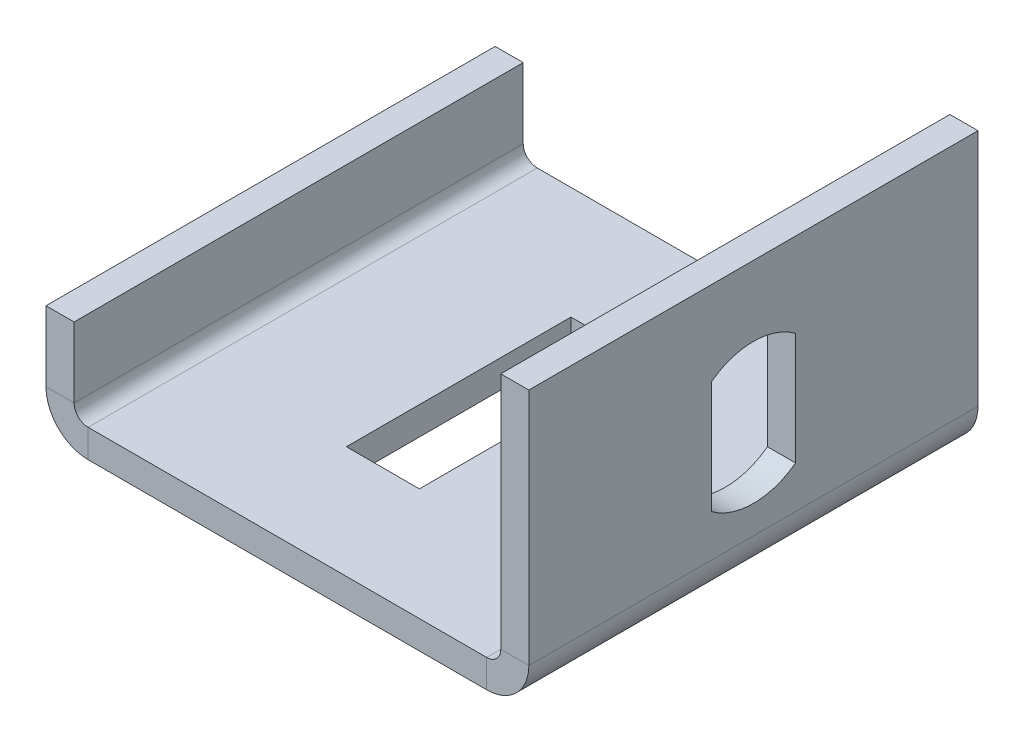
ISO-10303-21;
HEADER;
FILE_DESCRIPTION(('STEP AP214'),'2;1');
FILE_NAME('part.step','',(''),(''),'','','');
FILE_SCHEMA(('AUTOMOTIVE_DESIGN { 1 0 10303 214 1 1 1 1 }'));
ENDSEC;
DATA;
#1=APPLICATION_CONTEXT('core data for automotive mechanical design processes');
#2=APPLICATION_PROTOCOL_DEFINITION('international standard','automotive_design',2000,#1);
#3=PRODUCT_CONTEXT('',#1,'mechanical');
#4=PRODUCT('Part','Part','',(#3));
#5=PRODUCT_RELATED_PRODUCT_CATEGORY('part','',(#4));
#6=PRODUCT_DEFINITION_FORMATION('','',#4);
#7=PRODUCT_DEFINITION_CONTEXT('part definition',#1,'design');
#8=PRODUCT_DEFINITION('design','',#6,#7);
#9=PRODUCT_DEFINITION_SHAPE('','',#8);
#10=(LENGTH_UNIT() NAMED_UNIT(*) SI_UNIT(.MILLI.,.METRE.));
#11=(NAMED_UNIT(*) PLANE_ANGLE_UNIT() SI_UNIT($,.RADIAN.));
#12=(NAMED_UNIT(*) SI_UNIT($,.STERADIAN.) SOLID_ANGLE_UNIT());
#13=UNCERTAINTY_MEASURE_WITH_UNIT(LENGTH_MEASURE(1.E-05),#10,'distance_accuracy_value','');
#14=(GEOMETRIC_REPRESENTATION_CONTEXT(3) GLOBAL_UNCERTAINTY_ASSIGNED_CONTEXT((#13)) GLOBAL_UNIT_ASSIGNED_CONTEXT((#10,
#11,#12)) REPRESENTATION_CONTEXT('',''));
#15=CARTESIAN_POINT('',(0.,0.,0.));
#16=DIRECTION('',(0.,0.,1.));
#17=DIRECTION('',(1.,0.,0.));
#18=AXIS2_PLACEMENT_3D('',#15,#16,#17);
#19=CARTESIAN_POINT('',(166.941347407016,0.,80.));
#20=DIRECTION('',(0.,1.,0.));
#21=DIRECTION('',(-1.,0.,0.));
#22=AXIS2_PLACEMENT_3D('',#19,#20,#21);
#23=PLANE('',#22);
#24=DIRECTION('',(0.,0.,-1.));
#25=VECTOR('',#24,1.);
#26=CARTESIAN_POINT('',(0.,0.,80.));
#27=LINE('',#26,#25);
#28=CARTESIAN_POINT('',(0.,0.,80.));
#29=VERTEX_POINT('',#28);
#30=CARTESIAN_POINT('',(0.,0.,0.));
#31=VERTEX_POINT('',#30);
#32=EDGE_CURVE('E353',#29,#31,#27,.T.);
#33=ORIENTED_EDGE('',*,*,#32,.F.);
#34=DIRECTION('',(-1.,0.,0.));
#35=VECTOR('',#34,1.);
#36=CARTESIAN_POINT('',(166.941347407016,0.,80.));
#37=LINE('',#36,#35);
#38=CARTESIAN_POINT('',(4.99999999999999,0.,80.));
#39=VERTEX_POINT('',#38);
#40=EDGE_CURVE('E51',#39,#29,#37,.T.);
#41=ORIENTED_EDGE('',*,*,#40,.F.);
#42=DIRECTION('',(0.,0.,-1.));
#43=VECTOR('',#42,1.);
#44=CARTESIAN_POINT('',(5.,0.,80.));
#45=LINE('',#44,#43);
#46=CARTESIAN_POINT('',(4.99999999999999,0.,0.));
#47=VERTEX_POINT('',#46);
#48=EDGE_CURVE('E72',#39,#47,#45,.T.);
#49=ORIENTED_EDGE('',*,*,#48,.T.);
#50=DIRECTION('',(-1.,0.,0.));
#51=VECTOR('',#50,1.);
#52=CARTESIAN_POINT('',(166.941347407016,0.,0.));
#53=LINE('',#52,#51);
#54=EDGE_CURVE('E361',#47,#31,#53,.T.);
#55=ORIENTED_EDGE('',*,*,#54,.T.);
#56=EDGE_LOOP('',(#33,#41,#49,#55));
#57=FACE_BOUND('',#56,.T.);
#58=ADVANCED_FACE('F32',(#57),#23,.T.);
#59=CARTESIAN_POINT('',(166.941347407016,0.,0.));
#60=DIRECTION('',(0.,0.,1.));
#61=DIRECTION('',(0.,-1.,0.));
#62=AXIS2_PLACEMENT_3D('',#59,#60,#61);
#63=PLANE('',#62);
#64=DIRECTION('',(-1.,0.,0.));
#65=VECTOR('',#64,1.);
#66=CARTESIAN_POINT('',(166.941347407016,-12.5,0.));
#67=LINE('',#66,#65);
#68=CARTESIAN_POINT('',(5.,-12.5,0.));
#69=VERTEX_POINT('',#68);
#70=CARTESIAN_POINT('',(0.,-12.5,0.));
#71=VERTEX_POINT('',#70);
#72=EDGE_CURVE('E207',#69,#71,#67,.T.);
#73=ORIENTED_EDGE('',*,*,#72,.T.);
#74=DIRECTION('',(0.,-1.,0.));
#75=VECTOR('',#74,1.);
#76=CARTESIAN_POINT('',(0.,-9.99999999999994,0.));
#77=LINE('',#76,#75);
#78=EDGE_CURVE('E66',#31,#71,#77,.T.);
#79=ORIENTED_EDGE('',*,*,#78,.F.);
#80=ORIENTED_EDGE('',*,*,#54,.F.);
#81=DIRECTION('',(0.,1.,0.));
#82=VECTOR('',#81,1.);
#83=CARTESIAN_POINT('',(5.,0.,0.));
#84=LINE('',#83,#82);
#85=EDGE_CURVE('E11',#69,#47,#84,.T.);
#86=ORIENTED_EDGE('',*,*,#85,.F.);
#87=EDGE_LOOP('',(#73,#79,#80,#86));
#88=FACE_BOUND('',#87,.T.);
#89=ADVANCED_FACE('F379',(#88),#63,.F.);
#90=CARTESIAN_POINT('',(0.,-9.99999999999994,80.));
#91=DIRECTION('',(1.,0.,0.));
#92=DIRECTION('',(0.,0.,-1.));
#93=AXIS2_PLACEMENT_3D('',#90,#91,#92);
#94=PLANE('',#93);
#95=ORIENTED_EDGE('',*,*,#78,.T.);
#96=DIRECTION('',(0.,0.,1.));
#97=VECTOR('',#96,1.);
#98=CARTESIAN_POINT('',(0.,-12.5,0.));
#99=LINE('',#98,#97);
#100=CARTESIAN_POINT('',(0.,-12.5,80.));
#101=VERTEX_POINT('',#100);
#102=EDGE_CURVE('E356',#71,#101,#99,.T.);
#103=ORIENTED_EDGE('',*,*,#102,.T.);
#104=DIRECTION('',(0.,-1.,0.));
#105=VECTOR('',#104,1.);
#106=CARTESIAN_POINT('',(0.,-9.99999999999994,80.));
#107=LINE('',#106,#105);
#108=EDGE_CURVE('E351',#29,#101,#107,.T.);
#109=ORIENTED_EDGE('',*,*,#108,.F.);
#110=ORIENTED_EDGE('',*,*,#32,.T.);
#111=EDGE_LOOP('',(#95,#103,#109,#110));
#112=FACE_BOUND('',#111,.T.);
#113=ADVANCED_FACE('F370',(#112),#94,.F.);
#114=CARTESIAN_POINT('',(166.941347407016,-9.99999999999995,80.));
#115=DIRECTION('',(0.,0.,1.));
#116=DIRECTION('',(0.,-1.,0.));
#117=AXIS2_PLACEMENT_3D('',#114,#115,#116);
#118=PLANE('',#117);
#119=ORIENTED_EDGE('',*,*,#108,.T.);
#120=DIRECTION('',(-1.,0.,0.));
#121=VECTOR('',#120,1.);
#122=CARTESIAN_POINT('',(166.941347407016,-12.5,80.));
#123=LINE('',#122,#121);
#124=CARTESIAN_POINT('',(5.,-12.5,80.));
#125=VERTEX_POINT('',#124);
#126=EDGE_CURVE('E36',#125,#101,#123,.T.);
#127=ORIENTED_EDGE('',*,*,#126,.F.);
#128=DIRECTION('',(0.,-1.,0.));
#129=VECTOR('',#128,1.);
#130=CARTESIAN_POINT('',(4.99999999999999,-9.99999999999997,80.));
#131=LINE('',#130,#129);
#132=EDGE_CURVE('E347',#39,#125,#131,.T.);
#133=ORIENTED_EDGE('',*,*,#132,.F.);
#134=ORIENTED_EDGE('',*,*,#40,.T.);
#135=EDGE_LOOP('',(#119,#127,#133,#134));
#136=FACE_BOUND('',#135,.T.);
#137=ADVANCED_FACE('F371',(#136),#118,.T.);
#138=CARTESIAN_POINT('',(5.,0.,80.));
#139=DIRECTION('',(-1.,0.,0.));
#140=DIRECTION('',(0.,-1.,0.));
#141=AXIS2_PLACEMENT_3D('',#138,#139,#140);
#142=PLANE('',#141);
#143=ORIENTED_EDGE('',*,*,#132,.T.);
#144=DIRECTION('',(0.,0.,-1.));
#145=VECTOR('',#144,1.);
#146=CARTESIAN_POINT('',(4.99999999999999,-12.5,0.));
#147=LINE('',#146,#145);
#148=EDGE_CURVE('E42',#125,#69,#147,.T.);
#149=ORIENTED_EDGE('',*,*,#148,.T.);
#150=ORIENTED_EDGE('',*,*,#85,.T.);
#151=ORIENTED_EDGE('',*,*,#48,.F.);
#152=EDGE_LOOP('',(#143,#149,#150,#151));
#153=FACE_BOUND('',#152,.T.);
#154=ADVANCED_FACE('F34',(#153),#142,.F.);
#155=CARTESIAN_POINT('',(161.,-4.99999999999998,47.5));
#156=DIRECTION('',(0.,0.,1.));
#157=DIRECTION('',(1.,0.,0.));
#158=AXIS2_PLACEMENT_3D('',#155,#156,#157);
#159=PLANE('',#158);
#160=DIRECTION('',(-1.,0.,0.));
#161=VECTOR('',#160,1.);
#162=CARTESIAN_POINT('',(161.,-4.99999999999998,47.5));
#163=LINE('',#162,#161);
#164=CARTESIAN_POINT('',(86.,-4.99999999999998,47.5));
#165=VERTEX_POINT('',#164);
#166=CARTESIAN_POINT('',(81.,-4.99999999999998,47.5));
#167=VERTEX_POINT('',#166);
#168=EDGE_CURVE('E340',#165,#167,#163,.T.);
#169=ORIENTED_EDGE('',*,*,#168,.T.);
#170=DIRECTION('',(0.,1.,0.));
#171=VECTOR('',#170,1.);
#172=CARTESIAN_POINT('',(81.,-4.99999999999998,47.5));
#173=LINE('',#172,#171);
#174=CARTESIAN_POINT('',(81.,15.,47.5));
#175=VERTEX_POINT('',#174);
#176=EDGE_CURVE('E338',#167,#175,#173,.T.);
#177=ORIENTED_EDGE('',*,*,#176,.T.);
#178=DIRECTION('',(-1.,0.,0.));
#179=VECTOR('',#178,1.);
#180=CARTESIAN_POINT('',(161.,15.,47.5));
#181=LINE('',#180,#179);
#182=CARTESIAN_POINT('',(86.,15.,47.5));
#183=VERTEX_POINT('',#182);
#184=EDGE_CURVE('E124',#183,#175,#181,.T.);
#185=ORIENTED_EDGE('',*,*,#184,.F.);
#186=DIRECTION('',(0.,1.,0.));
#187=VECTOR('',#186,1.);
#188=CARTESIAN_POINT('',(86.,30.,47.5));
#189=LINE('',#188,#187);
#190=EDGE_CURVE('E298',#165,#183,#189,.T.);
#191=ORIENTED_EDGE('',*,*,#190,.F.);
#192=EDGE_LOOP('',(#169,#177,#185,#191));
#193=FACE_BOUND('',#192,.T.);
#194=ADVANCED_FACE('F377',(#193),#159,.F.);
#195=CARTESIAN_POINT('',(161.,5.00000000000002,40.));
#196=DIRECTION('',(-1.,0.,0.));
#197=DIRECTION('',(0.,0.,1.));
#198=AXIS2_PLACEMENT_3D('',#195,#196,#197);
#199=CYLINDRICAL_SURFACE('',#198,12.5);
#200=DIRECTION('',(-1.,0.,0.));
#201=VECTOR('',#200,1.);
#202=CARTESIAN_POINT('',(161.,-4.99999999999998,32.5));
#203=LINE('',#202,#201);
#204=CARTESIAN_POINT('',(86.,-4.99999999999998,32.5));
#205=VERTEX_POINT('',#204);
#206=CARTESIAN_POINT('',(81.,-4.99999999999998,32.5));
#207=VERTEX_POINT('',#206);
#208=EDGE_CURVE('E336',#205,#207,#203,.T.);
#209=ORIENTED_EDGE('',*,*,#208,.T.);
#210=CARTESIAN_POINT('',(81.,5.00000000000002,40.));
#211=DIRECTION('',(-1.,0.,0.));
#212=DIRECTION('',(0.,0.,1.));
#213=AXIS2_PLACEMENT_3D('',#210,#211,#212);
#214=CIRCLE('',#213,12.5);
#215=EDGE_CURVE('E117',#207,#167,#214,.T.);
#216=ORIENTED_EDGE('',*,*,#215,.T.);
#217=ORIENTED_EDGE('',*,*,#168,.F.);
#218=CARTESIAN_POINT('',(86.,5.00000000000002,40.));
#219=DIRECTION('',(-1.,0.,0.));
#220=DIRECTION('',(0.,0.,1.));
#221=AXIS2_PLACEMENT_3D('',#218,#219,#220);
#222=CIRCLE('',#221,12.5);
#223=EDGE_CURVE('E301',#205,#165,#222,.T.);
#224=ORIENTED_EDGE('',*,*,#223,.F.);
#225=EDGE_LOOP('',(#209,#216,#217,#224));
#226=FACE_BOUND('',#225,.T.);
#227=ADVANCED_FACE('F416',(#226),#199,.F.);
#228=CARTESIAN_POINT('',(161.,-4.99999999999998,32.5));
#229=DIRECTION('',(0.,0.,-1.));
#230=DIRECTION('',(-1.,0.,0.));
#231=AXIS2_PLACEMENT_3D('',#228,#229,#230);
#232=PLANE('',#231);
#233=DIRECTION('',(-1.,0.,0.));
#234=VECTOR('',#233,1.);
#235=CARTESIAN_POINT('',(161.,15.,32.5));
#236=LINE('',#235,#234);
#237=CARTESIAN_POINT('',(86.,15.,32.5));
#238=VERTEX_POINT('',#237);
#239=CARTESIAN_POINT('',(81.,15.,32.5));
#240=VERTEX_POINT('',#239);
#241=EDGE_CURVE('E332',#238,#240,#236,.T.);
#242=ORIENTED_EDGE('',*,*,#241,.T.);
#243=DIRECTION('',(0.,-1.,0.));
#244=VECTOR('',#243,1.);
#245=CARTESIAN_POINT('',(81.,-4.99999999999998,32.5));
#246=LINE('',#245,#244);
#247=EDGE_CURVE('E329',#240,#207,#246,.T.);
#248=ORIENTED_EDGE('',*,*,#247,.T.);
#249=ORIENTED_EDGE('',*,*,#208,.F.);
#250=DIRECTION('',(0.,-1.,0.));
#251=VECTOR('',#250,1.);
#252=CARTESIAN_POINT('',(86.,30.,32.5));
#253=LINE('',#252,#251);
#254=EDGE_CURVE('E304',#238,#205,#253,.T.);
#255=ORIENTED_EDGE('',*,*,#254,.F.);
#256=EDGE_LOOP('',(#242,#248,#249,#255));
#257=FACE_BOUND('',#256,.T.);
#258=ADVANCED_FACE('F412',(#257),#232,.F.);
#259=CARTESIAN_POINT('',(161.,5.00000000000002,40.));
#260=DIRECTION('',(-1.,0.,0.));
#261=DIRECTION('',(0.,0.,1.));
#262=AXIS2_PLACEMENT_3D('',#259,#260,#261);
#263=CYLINDRICAL_SURFACE('',#262,12.5);
#264=ORIENTED_EDGE('',*,*,#184,.T.);
#265=CARTESIAN_POINT('',(81.,5.00000000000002,40.));
#266=DIRECTION('',(-1.,0.,0.));
#267=DIRECTION('',(0.,0.,1.));
#268=AXIS2_PLACEMENT_3D('',#265,#266,#267);
#269=CIRCLE('',#268,12.5);
#270=EDGE_CURVE('E325',#175,#240,#269,.T.);
#271=ORIENTED_EDGE('',*,*,#270,.T.);
#272=ORIENTED_EDGE('',*,*,#241,.F.);
#273=CARTESIAN_POINT('',(86.,5.00000000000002,40.));
#274=DIRECTION('',(-1.,0.,0.));
#275=DIRECTION('',(0.,0.,1.));
#276=AXIS2_PLACEMENT_3D('',#273,#274,#275);
#277=CIRCLE('',#276,12.5);
#278=EDGE_CURVE('E307',#183,#238,#277,.T.);
#279=ORIENTED_EDGE('',*,*,#278,.F.);
#280=EDGE_LOOP('',(#264,#271,#272,#279));
#281=FACE_BOUND('',#280,.T.);
#282=ADVANCED_FACE('F408',(#281),#263,.F.);
#283=CARTESIAN_POINT('',(-100.176709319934,30.,80.));
#284=DIRECTION('',(0.,-1.,0.));
#285=DIRECTION('',(1.,0.,0.));
#286=AXIS2_PLACEMENT_3D('',#283,#284,#285);
#287=PLANE('',#286);
#288=DIRECTION('',(1.,0.,0.));
#289=VECTOR('',#288,1.);
#290=CARTESIAN_POINT('',(-100.176709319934,30.,80.));
#291=LINE('',#290,#289);
#292=CARTESIAN_POINT('',(81.,30.,80.));
#293=VERTEX_POINT('',#292);
#294=CARTESIAN_POINT('',(86.,30.,80.));
#295=VERTEX_POINT('',#294);
#296=EDGE_CURVE('E322',#293,#295,#291,.T.);
#297=ORIENTED_EDGE('',*,*,#296,.T.);
#298=DIRECTION('',(0.,0.,-1.));
#299=VECTOR('',#298,1.);
#300=CARTESIAN_POINT('',(86.,30.,80.));
#301=LINE('',#300,#299);
#302=CARTESIAN_POINT('',(86.,30.,0.));
#303=VERTEX_POINT('',#302);
#304=EDGE_CURVE('E319',#295,#303,#301,.T.);
#305=ORIENTED_EDGE('',*,*,#304,.T.);
#306=DIRECTION('',(1.,0.,0.));
#307=VECTOR('',#306,1.);
#308=CARTESIAN_POINT('',(-100.176709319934,30.,0.));
#309=LINE('',#308,#307);
#310=CARTESIAN_POINT('',(81.,30.,0.));
#311=VERTEX_POINT('',#310);
#312=EDGE_CURVE('E292',#311,#303,#309,.T.);
#313=ORIENTED_EDGE('',*,*,#312,.F.);
#314=DIRECTION('',(0.,0.,-1.));
#315=VECTOR('',#314,1.);
#316=CARTESIAN_POINT('',(81.,30.,80.));
#317=LINE('',#316,#315);
#318=EDGE_CURVE('E80',#293,#311,#317,.T.);
#319=ORIENTED_EDGE('',*,*,#318,.F.);
#320=EDGE_LOOP('',(#297,#305,#313,#319));
#321=FACE_BOUND('',#320,.T.);
#322=ADVANCED_FACE('F404',(#321),#287,.F.);
#323=CARTESIAN_POINT('',(-100.176709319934,-9.99999999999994,80.));
#324=DIRECTION('',(0.,0.,1.));
#325=DIRECTION('',(0.,1.,0.));
#326=AXIS2_PLACEMENT_3D('',#323,#324,#325);
#327=PLANE('',#326);
#328=DIRECTION('',(0.,1.,0.));
#329=VECTOR('',#328,1.);
#330=CARTESIAN_POINT('',(86.,-9.99999999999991,80.));
#331=LINE('',#330,#329);
#332=CARTESIAN_POINT('',(86.,-12.5,80.));
#333=VERTEX_POINT('',#332);
#334=EDGE_CURVE('E316',#333,#295,#331,.T.);
#335=ORIENTED_EDGE('',*,*,#334,.T.);
#336=ORIENTED_EDGE('',*,*,#296,.F.);
#337=DIRECTION('',(0.,-1.,0.));
#338=VECTOR('',#337,1.);
#339=CARTESIAN_POINT('',(81.,-9.99999999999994,80.));
#340=LINE('',#339,#338);
#341=CARTESIAN_POINT('',(81.,-12.5,80.));
#342=VERTEX_POINT('',#341);
#343=EDGE_CURVE('E313',#293,#342,#340,.T.);
#344=ORIENTED_EDGE('',*,*,#343,.T.);
#345=DIRECTION('',(1.,0.,0.));
#346=VECTOR('',#345,1.);
#347=CARTESIAN_POINT('',(-100.176709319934,-12.5,80.));
#348=LINE('',#347,#346);
#349=EDGE_CURVE('E310',#342,#333,#348,.T.);
#350=ORIENTED_EDGE('',*,*,#349,.T.);
#351=EDGE_LOOP('',(#335,#336,#344,#350));
#352=FACE_BOUND('',#351,.T.);
#353=ADVANCED_FACE('F400',(#352),#327,.T.);
#354=CARTESIAN_POINT('',(86.,30.,80.));
#355=DIRECTION('',(-1.,0.,0.));
#356=DIRECTION('',(0.,0.,1.));
#357=AXIS2_PLACEMENT_3D('',#354,#355,#356);
#358=PLANE('',#357);
#359=ORIENTED_EDGE('',*,*,#278,.T.);
#360=ORIENTED_EDGE('',*,*,#254,.T.);
#361=ORIENTED_EDGE('',*,*,#223,.T.);
#362=ORIENTED_EDGE('',*,*,#190,.T.);
#363=EDGE_LOOP('',(#359,#360,#361,#362));
#364=FACE_BOUND('',#363,.T.);
#365=ORIENTED_EDGE('',*,*,#334,.F.);
#366=DIRECTION('',(0.,0.,-1.));
#367=VECTOR('',#366,1.);
#368=CARTESIAN_POINT('',(86.,-12.5,80.));
#369=LINE('',#368,#367);
#370=CARTESIAN_POINT('',(86.,-12.5,0.));
#371=VERTEX_POINT('',#370);
#372=EDGE_CURVE('E295',#333,#371,#369,.T.);
#373=ORIENTED_EDGE('',*,*,#372,.T.);
#374=DIRECTION('',(0.,-1.,0.));
#375=VECTOR('',#374,1.);
#376=CARTESIAN_POINT('',(86.,-9.99999999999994,0.));
#377=LINE('',#376,#375);
#378=EDGE_CURVE('E289',#303,#371,#377,.T.);
#379=ORIENTED_EDGE('',*,*,#378,.F.);
#380=ORIENTED_EDGE('',*,*,#304,.F.);
#381=EDGE_LOOP('',(#365,#373,#379,#380));
#382=FACE_BOUND('',#381,.T.);
#383=ADVANCED_FACE('F396',(#364,#382),#358,.F.);
#384=CARTESIAN_POINT('',(-100.176709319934,-9.99999999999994,0.));
#385=DIRECTION('',(0.,0.,1.));
#386=DIRECTION('',(0.,1.,0.));
#387=AXIS2_PLACEMENT_3D('',#384,#385,#386);
#388=PLANE('',#387);
#389=ORIENTED_EDGE('',*,*,#312,.T.);
#390=ORIENTED_EDGE('',*,*,#378,.T.);
#391=DIRECTION('',(1.,0.,0.));
#392=VECTOR('',#391,1.);
#393=CARTESIAN_POINT('',(-100.176709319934,-12.5,0.));
#394=LINE('',#393,#392);
#395=CARTESIAN_POINT('',(81.,-12.5,0.));
#396=VERTEX_POINT('',#395);
#397=EDGE_CURVE('E282',#396,#371,#394,.T.);
#398=ORIENTED_EDGE('',*,*,#397,.F.);
#399=DIRECTION('',(0.,-1.,0.));
#400=VECTOR('',#399,1.);
#401=CARTESIAN_POINT('',(81.,-9.99999999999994,0.));
#402=LINE('',#401,#400);
#403=EDGE_CURVE('E287',#311,#396,#402,.T.);
#404=ORIENTED_EDGE('',*,*,#403,.F.);
#405=EDGE_LOOP('',(#389,#390,#398,#404));
#406=FACE_BOUND('',#405,.T.);
#407=ADVANCED_FACE('F392',(#406),#388,.F.);
#408=CARTESIAN_POINT('',(81.,-9.99999999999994,80.));
#409=DIRECTION('',(1.,0.,0.));
#410=DIRECTION('',(0.,0.,-1.));
#411=AXIS2_PLACEMENT_3D('',#408,#409,#410);
#412=PLANE('',#411);
#413=ORIENTED_EDGE('',*,*,#215,.F.);
#414=ORIENTED_EDGE('',*,*,#247,.F.);
#415=ORIENTED_EDGE('',*,*,#270,.F.);
#416=ORIENTED_EDGE('',*,*,#176,.F.);
#417=EDGE_LOOP('',(#413,#414,#415,#416));
#418=FACE_BOUND('',#417,.T.);
#419=ORIENTED_EDGE('',*,*,#403,.T.);
#420=DIRECTION('',(0.,0.,1.));
#421=VECTOR('',#420,1.);
#422=CARTESIAN_POINT('',(81.,-12.5,80.));
#423=LINE('',#422,#421);
#424=EDGE_CURVE('E284',#396,#342,#423,.T.);
#425=ORIENTED_EDGE('',*,*,#424,.T.);
#426=ORIENTED_EDGE('',*,*,#343,.F.);
#427=ORIENTED_EDGE('',*,*,#318,.T.);
#428=EDGE_LOOP('',(#419,#425,#426,#427));
#429=FACE_BOUND('',#428,.T.);
#430=ADVANCED_FACE('F388',(#418,#429),#412,.F.);
#431=CARTESIAN_POINT('',(75.9999999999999,-20.,80.));
#432=DIRECTION('',(0.,1.,0.));
#433=DIRECTION('',(0.,0.,1.));
#434=AXIS2_PLACEMENT_3D('',#431,#432,#433);
#435=PLANE('',#434);
#436=DIRECTION('',(-1.,0.,0.));
#437=VECTOR('',#436,1.);
#438=CARTESIAN_POINT('',(75.9999999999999,-20.,20.));
#439=LINE('',#438,#437);
#440=CARTESIAN_POINT('',(46.5,-20.,20.));
#441=VERTEX_POINT('',#440);
#442=CARTESIAN_POINT('',(33.5,-20.,20.));
#443=VERTEX_POINT('',#442);
#444=EDGE_CURVE('E264',#441,#443,#439,.T.);
#445=ORIENTED_EDGE('',*,*,#444,.T.);
#446=DIRECTION('',(0.,0.,1.));
#447=VECTOR('',#446,1.);
#448=CARTESIAN_POINT('',(33.5,-20.,80.));
#449=LINE('',#448,#447);
#450=CARTESIAN_POINT('',(33.5,-20.,60.));
#451=VERTEX_POINT('',#450);
#452=EDGE_CURVE('E258',#443,#451,#449,.T.);
#453=ORIENTED_EDGE('',*,*,#452,.T.);
#454=DIRECTION('',(1.,0.,0.));
#455=VECTOR('',#454,1.);
#456=CARTESIAN_POINT('',(75.9999999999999,-20.,60.));
#457=LINE('',#456,#455);
#458=CARTESIAN_POINT('',(46.5,-20.,60.));
#459=VERTEX_POINT('',#458);
#460=EDGE_CURVE('E252',#451,#459,#457,.T.);
#461=ORIENTED_EDGE('',*,*,#460,.T.);
#462=DIRECTION('',(0.,0.,-1.));
#463=VECTOR('',#462,1.);
#464=CARTESIAN_POINT('',(46.5,-20.,80.));
#465=LINE('',#464,#463);
#466=EDGE_CURVE('E267',#459,#441,#465,.T.);
#467=ORIENTED_EDGE('',*,*,#466,.T.);
#468=EDGE_LOOP('',(#445,#453,#461,#467));
#469=FACE_BOUND('',#468,.T.);
#470=DIRECTION('',(0.,0.,1.));
#471=VECTOR('',#470,1.);
#472=CARTESIAN_POINT('',(7.5,-20.,0.));
#473=LINE('',#472,#471);
#474=CARTESIAN_POINT('',(7.5,-20.,0.));
#475=VERTEX_POINT('',#474);
#476=CARTESIAN_POINT('',(7.50000000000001,-20.,80.));
#477=VERTEX_POINT('',#476);
#478=EDGE_CURVE('E138',#475,#477,#473,.T.);
#479=ORIENTED_EDGE('',*,*,#478,.F.);
#480=DIRECTION('',(1.,0.,0.));
#481=VECTOR('',#480,1.);
#482=CARTESIAN_POINT('',(75.9999999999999,-20.,0.));
#483=LINE('',#482,#481);
#484=CARTESIAN_POINT('',(78.5,-19.9999999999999,0.));
#485=VERTEX_POINT('',#484);
#486=EDGE_CURVE('E230',#475,#485,#483,.T.);
#487=ORIENTED_EDGE('',*,*,#486,.T.);
#488=DIRECTION('',(0.,0.,-1.));
#489=VECTOR('',#488,1.);
#490=CARTESIAN_POINT('',(78.5,-20.,80.));
#491=LINE('',#490,#489);
#492=CARTESIAN_POINT('',(78.5,-20.,80.));
#493=VERTEX_POINT('',#492);
#494=EDGE_CURVE('E131',#493,#485,#491,.T.);
#495=ORIENTED_EDGE('',*,*,#494,.F.);
#496=DIRECTION('',(1.,0.,0.));
#497=VECTOR('',#496,1.);
#498=CARTESIAN_POINT('',(10.0000000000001,-20.,80.));
#499=LINE('',#498,#497);
#500=EDGE_CURVE('E221',#477,#493,#499,.T.);
#501=ORIENTED_EDGE('',*,*,#500,.F.);
#502=EDGE_LOOP('',(#479,#487,#495,#501));
#503=FACE_BOUND('',#502,.T.);
#504=ADVANCED_FACE('F391',(#469,#503),#435,.F.);
#505=CARTESIAN_POINT('',(5.,-15.,80.));
#506=DIRECTION('',(0.,-1.,0.));
#507=DIRECTION('',(0.,0.,-1.));
#508=AXIS2_PLACEMENT_3D('',#505,#506,#507);
#509=PLANE('',#508);
#510=DIRECTION('',(1.,0.,0.));
#511=VECTOR('',#510,1.);
#512=CARTESIAN_POINT('',(33.5,-15.,60.));
#513=LINE('',#512,#511);
#514=CARTESIAN_POINT('',(33.5,-15.,60.));
#515=VERTEX_POINT('',#514);
#516=CARTESIAN_POINT('',(46.5,-15.,60.));
#517=VERTEX_POINT('',#516);
#518=EDGE_CURVE('E686',#515,#517,#513,.T.);
#519=ORIENTED_EDGE('',*,*,#518,.F.);
#520=DIRECTION('',(0.,0.,1.));
#521=VECTOR('',#520,1.);
#522=CARTESIAN_POINT('',(33.5,-15.,20.));
#523=LINE('',#522,#521);
#524=CARTESIAN_POINT('',(33.5,-15.,20.));
#525=VERTEX_POINT('',#524);
#526=EDGE_CURVE('E688',#525,#515,#523,.T.);
#527=ORIENTED_EDGE('',*,*,#526,.F.);
#528=DIRECTION('',(-1.,0.,0.));
#529=VECTOR('',#528,1.);
#530=CARTESIAN_POINT('',(33.5,-15.,20.));
#531=LINE('',#530,#529);
#532=CARTESIAN_POINT('',(46.5,-15.,20.));
#533=VERTEX_POINT('',#532);
#534=EDGE_CURVE('E243',#533,#525,#531,.T.);
#535=ORIENTED_EDGE('',*,*,#534,.F.);
#536=DIRECTION('',(0.,0.,-1.));
#537=VECTOR('',#536,1.);
#538=CARTESIAN_POINT('',(46.5,-15.,20.));
#539=LINE('',#538,#537);
#540=EDGE_CURVE('E238',#517,#533,#539,.T.);
#541=ORIENTED_EDGE('',*,*,#540,.F.);
#542=EDGE_LOOP('',(#519,#527,#535,#541));
#543=FACE_BOUND('',#542,.T.);
#544=DIRECTION('',(0.,0.,-1.));
#545=VECTOR('',#544,1.);
#546=CARTESIAN_POINT('',(7.5,-15.,0.));
#547=LINE('',#546,#545);
#548=CARTESIAN_POINT('',(7.50000000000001,-15.,80.));
#549=VERTEX_POINT('',#548);
#550=CARTESIAN_POINT('',(7.5,-15.,0.));
#551=VERTEX_POINT('',#550);
#552=EDGE_CURVE('E214',#549,#551,#547,.T.);
#553=ORIENTED_EDGE('',*,*,#552,.F.);
#554=DIRECTION('',(-1.,0.,0.));
#555=VECTOR('',#554,1.);
#556=CARTESIAN_POINT('',(76.,-15.,80.));
#557=LINE('',#556,#555);
#558=CARTESIAN_POINT('',(78.5,-15.,80.));
#559=VERTEX_POINT('',#558);
#560=EDGE_CURVE('E237',#559,#549,#557,.T.);
#561=ORIENTED_EDGE('',*,*,#560,.F.);
#562=DIRECTION('',(0.,0.,1.));
#563=VECTOR('',#562,1.);
#564=CARTESIAN_POINT('',(78.5,-15.,80.));
#565=LINE('',#564,#563);
#566=CARTESIAN_POINT('',(78.5,-15.,0.));
#567=VERTEX_POINT('',#566);
#568=EDGE_CURVE('E231',#567,#559,#565,.T.);
#569=ORIENTED_EDGE('',*,*,#568,.F.);
#570=DIRECTION('',(-1.,0.,0.));
#571=VECTOR('',#570,1.);
#572=CARTESIAN_POINT('',(5.,-15.,0.));
#573=LINE('',#572,#571);
#574=EDGE_CURVE('E228',#567,#551,#573,.T.);
#575=ORIENTED_EDGE('',*,*,#574,.T.);
#576=EDGE_LOOP('',(#553,#561,#569,#575));
#577=FACE_BOUND('',#576,.T.);
#578=ADVANCED_FACE('F235',(#543,#577),#509,.F.);
#579=CARTESIAN_POINT('',(46.5,-95.,20.));
#580=DIRECTION('',(1.,0.,0.));
#581=DIRECTION('',(0.,0.,-1.));
#582=AXIS2_PLACEMENT_3D('',#579,#580,#581);
#583=PLANE('',#582);
#584=DIRECTION('',(0.,1.,0.));
#585=VECTOR('',#584,1.);
#586=CARTESIAN_POINT('',(46.5,-95.,60.));
#587=LINE('',#586,#585);
#588=EDGE_CURVE('E249',#459,#517,#587,.T.);
#589=ORIENTED_EDGE('',*,*,#588,.T.);
#590=ORIENTED_EDGE('',*,*,#540,.T.);
#591=DIRECTION('',(0.,1.,0.));
#592=VECTOR('',#591,1.);
#593=CARTESIAN_POINT('',(46.5,-95.,20.));
#594=LINE('',#593,#592);
#595=EDGE_CURVE('E261',#441,#533,#594,.T.);
#596=ORIENTED_EDGE('',*,*,#595,.F.);
#597=ORIENTED_EDGE('',*,*,#466,.F.);
#598=EDGE_LOOP('',(#589,#590,#596,#597));
#599=FACE_BOUND('',#598,.T.);
#600=ADVANCED_FACE('F426',(#599),#583,.F.);
#601=CARTESIAN_POINT('',(33.5,-95.,20.));
#602=DIRECTION('',(0.,0.,-1.));
#603=DIRECTION('',(-1.,0.,0.));
#604=AXIS2_PLACEMENT_3D('',#601,#602,#603);
#605=PLANE('',#604);
#606=ORIENTED_EDGE('',*,*,#595,.T.);
#607=ORIENTED_EDGE('',*,*,#534,.T.);
#608=DIRECTION('',(0.,1.,0.));
#609=VECTOR('',#608,1.);
#610=CARTESIAN_POINT('',(33.5,-95.,20.));
#611=LINE('',#610,#609);
#612=EDGE_CURVE('E255',#443,#525,#611,.T.);
#613=ORIENTED_EDGE('',*,*,#612,.F.);
#614=ORIENTED_EDGE('',*,*,#444,.F.);
#615=EDGE_LOOP('',(#606,#607,#613,#614));
#616=FACE_BOUND('',#615,.T.);
#617=ADVANCED_FACE('F436',(#616),#605,.F.);
#618=CARTESIAN_POINT('',(33.5,-95.,20.));
#619=DIRECTION('',(-1.,0.,0.));
#620=DIRECTION('',(0.,0.,1.));
#621=AXIS2_PLACEMENT_3D('',#618,#619,#620);
#622=PLANE('',#621);
#623=ORIENTED_EDGE('',*,*,#612,.T.);
#624=ORIENTED_EDGE('',*,*,#526,.T.);
#625=DIRECTION('',(0.,1.,0.));
#626=VECTOR('',#625,1.);
#627=CARTESIAN_POINT('',(33.5,-95.,60.));
#628=LINE('',#627,#626);
#629=EDGE_CURVE('E240',#451,#515,#628,.T.);
#630=ORIENTED_EDGE('',*,*,#629,.F.);
#631=ORIENTED_EDGE('',*,*,#452,.F.);
#632=EDGE_LOOP('',(#623,#624,#630,#631));
#633=FACE_BOUND('',#632,.T.);
#634=ADVANCED_FACE('F440',(#633),#622,.F.);
#635=CARTESIAN_POINT('',(33.5,-95.,60.));
#636=DIRECTION('',(0.,0.,1.));
#637=DIRECTION('',(1.,0.,0.));
#638=AXIS2_PLACEMENT_3D('',#635,#636,#637);
#639=PLANE('',#638);
#640=ORIENTED_EDGE('',*,*,#629,.T.);
#641=ORIENTED_EDGE('',*,*,#518,.T.);
#642=ORIENTED_EDGE('',*,*,#588,.F.);
#643=ORIENTED_EDGE('',*,*,#460,.F.);
#644=EDGE_LOOP('',(#640,#641,#642,#643));
#645=FACE_BOUND('',#644,.T.);
#646=ADVANCED_FACE('F425',(#645),#639,.F.);
#647=CARTESIAN_POINT('',(5.,198.925220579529,0.));
#648=DIRECTION('',(0.,0.,1.));
#649=DIRECTION('',(1.,0.,0.));
#650=AXIS2_PLACEMENT_3D('',#647,#648,#649);
#651=PLANE('',#650);
#652=DIRECTION('',(0.,-1.,0.));
#653=VECTOR('',#652,1.);
#654=CARTESIAN_POINT('',(78.5,198.925220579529,0.));
#655=LINE('',#654,#653);
#656=EDGE_CURVE('E274',#567,#485,#655,.T.);
#657=ORIENTED_EDGE('',*,*,#656,.T.);
#658=ORIENTED_EDGE('',*,*,#486,.F.);
#659=DIRECTION('',(0.,-1.,0.));
#660=VECTOR('',#659,1.);
#661=CARTESIAN_POINT('',(7.5,198.925220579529,0.));
#662=LINE('',#661,#660);
#663=EDGE_CURVE('E206',#551,#475,#662,.T.);
#664=ORIENTED_EDGE('',*,*,#663,.F.);
#665=ORIENTED_EDGE('',*,*,#574,.F.);
#666=EDGE_LOOP('',(#657,#658,#664,#665));
#667=FACE_BOUND('',#666,.T.);
#668=ADVANCED_FACE('F227',(#667),#651,.F.);
#669=CARTESIAN_POINT('',(76.,198.925220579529,80.));
#670=DIRECTION('',(0.,0.,1.));
#671=DIRECTION('',(1.,0.,0.));
#672=AXIS2_PLACEMENT_3D('',#669,#670,#671);
#673=PLANE('',#672);
#674=ORIENTED_EDGE('',*,*,#500,.T.);
#675=DIRECTION('',(0.,-1.,0.));
#676=VECTOR('',#675,1.);
#677=CARTESIAN_POINT('',(78.5,198.925220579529,80.));
#678=LINE('',#677,#676);
#679=EDGE_CURVE('E276',#559,#493,#678,.T.);
#680=ORIENTED_EDGE('',*,*,#679,.F.);
#681=ORIENTED_EDGE('',*,*,#560,.T.);
#682=DIRECTION('',(0.,-1.,0.));
#683=VECTOR('',#682,1.);
#684=CARTESIAN_POINT('',(7.50000000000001,198.925220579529,80.));
#685=LINE('',#684,#683);
#686=EDGE_CURVE('E232',#549,#477,#685,.T.);
#687=ORIENTED_EDGE('',*,*,#686,.T.);
#688=EDGE_LOOP('',(#674,#680,#681,#687));
#689=FACE_BOUND('',#688,.T.);
#690=ADVANCED_FACE('F424',(#689),#673,.T.);
#691=CARTESIAN_POINT('',(78.5,-12.5,80.));
#692=DIRECTION('',(0.,0.,1.));
#693=DIRECTION('',(1.,0.,0.));
#694=AXIS2_PLACEMENT_3D('',#691,#692,#693);
#695=PLANE('',#694);
#696=ORIENTED_EDGE('',*,*,#349,.F.);
#697=CARTESIAN_POINT('',(78.5,-12.5,80.));
#698=DIRECTION('',(0.,0.,-1.));
#699=DIRECTION('',(-1.,0.,0.));
#700=AXIS2_PLACEMENT_3D('',#697,#698,#699);
#701=CIRCLE('',#700,2.5);
#702=EDGE_CURVE('E676',#342,#559,#701,.T.);
#703=ORIENTED_EDGE('',*,*,#702,.T.);
#704=ORIENTED_EDGE('',*,*,#679,.T.);
#705=CARTESIAN_POINT('',(78.5,-12.5,80.));
#706=DIRECTION('',(0.,0.,-1.));
#707=DIRECTION('',(-1.,0.,0.));
#708=AXIS2_PLACEMENT_3D('',#705,#706,#707);
#709=CIRCLE('',#708,7.5);
#710=EDGE_CURVE('E680',#333,#493,#709,.T.);
#711=ORIENTED_EDGE('',*,*,#710,.F.);
#712=EDGE_LOOP('',(#696,#703,#704,#711));
#713=FACE_BOUND('',#712,.T.);
#714=ADVANCED_FACE('F429',(#713),#695,.T.);
#715=CARTESIAN_POINT('',(78.5,-12.5,0.));
#716=DIRECTION('',(0.,0.,-1.));
#717=DIRECTION('',(-1.,0.,0.));
#718=AXIS2_PLACEMENT_3D('',#715,#716,#717);
#719=PLANE('',#718);
#720=CARTESIAN_POINT('',(78.5,-12.5,0.));
#721=DIRECTION('',(0.,0.,-1.));
#722=DIRECTION('',(-1.,0.,0.));
#723=AXIS2_PLACEMENT_3D('',#720,#721,#722);
#724=CIRCLE('',#723,2.5);
#725=EDGE_CURVE('E678',#567,#396,#724,.F.);
#726=ORIENTED_EDGE('',*,*,#725,.T.);
#727=ORIENTED_EDGE('',*,*,#397,.T.);
#728=CARTESIAN_POINT('',(78.5,-12.5,0.));
#729=DIRECTION('',(0.,0.,-1.));
#730=DIRECTION('',(-1.,0.,0.));
#731=AXIS2_PLACEMENT_3D('',#728,#729,#730);
#732=CIRCLE('',#731,7.5);
#733=EDGE_CURVE('E682',#485,#371,#732,.F.);
#734=ORIENTED_EDGE('',*,*,#733,.F.);
#735=ORIENTED_EDGE('',*,*,#656,.F.);
#736=EDGE_LOOP('',(#726,#727,#734,#735));
#737=FACE_BOUND('',#736,.T.);
#738=ADVANCED_FACE('F451',(#737),#719,.T.);
#739=CARTESIAN_POINT('',(78.5,-12.5,236.045825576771));
#740=DIRECTION('',(0.,0.,-1.));
#741=DIRECTION('',(-1.,0.,0.));
#742=AXIS2_PLACEMENT_3D('',#739,#740,#741);
#743=CYLINDRICAL_SURFACE('',#742,7.5);
#744=ORIENTED_EDGE('',*,*,#494,.T.);
#745=ORIENTED_EDGE('',*,*,#733,.T.);
#746=ORIENTED_EDGE('',*,*,#372,.F.);
#747=ORIENTED_EDGE('',*,*,#710,.T.);
#748=EDGE_LOOP('',(#744,#745,#746,#747));
#749=FACE_BOUND('',#748,.T.);
#750=ADVANCED_FACE('F454',(#749),#743,.T.);
#751=CARTESIAN_POINT('',(78.5,-12.5,236.045825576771));
#752=DIRECTION('',(0.,0.,-1.));
#753=DIRECTION('',(-1.,0.,0.));
#754=AXIS2_PLACEMENT_3D('',#751,#752,#753);
#755=CYLINDRICAL_SURFACE('',#754,2.5);
#756=ORIENTED_EDGE('',*,*,#568,.T.);
#757=ORIENTED_EDGE('',*,*,#702,.F.);
#758=ORIENTED_EDGE('',*,*,#424,.F.);
#759=ORIENTED_EDGE('',*,*,#725,.F.);
#760=EDGE_LOOP('',(#756,#757,#758,#759));
#761=FACE_BOUND('',#760,.T.);
#762=ADVANCED_FACE('F456',(#761),#755,.F.);
#763=CARTESIAN_POINT('',(7.5,-12.5,0.));
#764=DIRECTION('',(0.,0.,-1.));
#765=DIRECTION('',(-1.,0.,0.));
#766=AXIS2_PLACEMENT_3D('',#763,#764,#765);
#767=PLANE('',#766);
#768=ORIENTED_EDGE('',*,*,#72,.F.);
#769=CARTESIAN_POINT('',(7.5,-12.5,0.));
#770=DIRECTION('',(0.,0.,1.));
#771=DIRECTION('',(1.,0.,0.));
#772=AXIS2_PLACEMENT_3D('',#769,#770,#771);
#773=CIRCLE('',#772,2.5);
#774=EDGE_CURVE('E201',#69,#551,#773,.T.);
#775=ORIENTED_EDGE('',*,*,#774,.T.);
#776=ORIENTED_EDGE('',*,*,#663,.T.);
#777=CARTESIAN_POINT('',(7.5,-12.5,0.));
#778=DIRECTION('',(0.,0.,1.));
#779=DIRECTION('',(1.,0.,0.));
#780=AXIS2_PLACEMENT_3D('',#777,#778,#779);
#781=CIRCLE('',#780,7.5);
#782=EDGE_CURVE('E702',#71,#475,#781,.T.);
#783=ORIENTED_EDGE('',*,*,#782,.F.);
#784=EDGE_LOOP('',(#768,#775,#776,#783));
#785=FACE_BOUND('',#784,.T.);
#786=ADVANCED_FACE('F203',(#785),#767,.T.);
#787=CARTESIAN_POINT('',(7.5,-12.5,80.));
#788=DIRECTION('',(0.,0.,1.));
#789=DIRECTION('',(1.,0.,0.));
#790=AXIS2_PLACEMENT_3D('',#787,#788,#789);
#791=PLANE('',#790);
#792=CARTESIAN_POINT('',(7.5,-12.5,80.));
#793=DIRECTION('',(0.,0.,1.));
#794=DIRECTION('',(1.,0.,0.));
#795=AXIS2_PLACEMENT_3D('',#792,#793,#794);
#796=CIRCLE('',#795,2.5);
#797=EDGE_CURVE('E210',#549,#125,#796,.F.);
#798=ORIENTED_EDGE('',*,*,#797,.T.);
#799=ORIENTED_EDGE('',*,*,#126,.T.);
#800=CARTESIAN_POINT('',(7.5,-12.5,80.));
#801=DIRECTION('',(0.,0.,1.));
#802=DIRECTION('',(1.,0.,0.));
#803=AXIS2_PLACEMENT_3D('',#800,#801,#802);
#804=CIRCLE('',#803,7.5);
#805=EDGE_CURVE('E366',#477,#101,#804,.F.);
#806=ORIENTED_EDGE('',*,*,#805,.F.);
#807=ORIENTED_EDGE('',*,*,#686,.F.);
#808=EDGE_LOOP('',(#798,#799,#806,#807));
#809=FACE_BOUND('',#808,.T.);
#810=ADVANCED_FACE('F365',(#809),#791,.T.);
#811=CARTESIAN_POINT('',(7.5,-12.5,-133.843625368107));
#812=DIRECTION('',(0.,0.,1.));
#813=DIRECTION('',(1.,0.,0.));
#814=AXIS2_PLACEMENT_3D('',#811,#812,#813);
#815=CYLINDRICAL_SURFACE('',#814,7.5);
#816=ORIENTED_EDGE('',*,*,#478,.T.);
#817=ORIENTED_EDGE('',*,*,#805,.T.);
#818=ORIENTED_EDGE('',*,*,#102,.F.);
#819=ORIENTED_EDGE('',*,*,#782,.T.);
#820=EDGE_LOOP('',(#816,#817,#818,#819));
#821=FACE_BOUND('',#820,.T.);
#822=ADVANCED_FACE('F467',(#821),#815,.T.);
#823=CARTESIAN_POINT('',(7.5,-12.5,-133.843625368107));
#824=DIRECTION('',(0.,0.,1.));
#825=DIRECTION('',(1.,0.,0.));
#826=AXIS2_PLACEMENT_3D('',#823,#824,#825);
#827=CYLINDRICAL_SURFACE('',#826,2.5);
#828=ORIENTED_EDGE('',*,*,#552,.T.);
#829=ORIENTED_EDGE('',*,*,#774,.F.);
#830=ORIENTED_EDGE('',*,*,#148,.F.);
#831=ORIENTED_EDGE('',*,*,#797,.F.);
#832=EDGE_LOOP('',(#828,#829,#830,#831));
#833=FACE_BOUND('',#832,.T.);
#834=ADVANCED_FACE('F215',(#833),#827,.F.);
#835=CLOSED_SHELL('',(#58,#89,#113,#137,#154,#194,#227,#258,#282,#322,#353,#383,#407,#430,#504,
#578,#600,#617,#634,#646,#668,#690,#714,#738,#750,#762,#786,#810,#822,#834));
#836=MANIFOLD_SOLID_BREP('B2',#835);
#837=ADVANCED_BREP_SHAPE_REPRESENTATION('',(#18,#836),#14);
#838=SHAPE_DEFINITION_REPRESENTATION(#9,#837);
ENDSEC;
END-ISO-10303-21;
